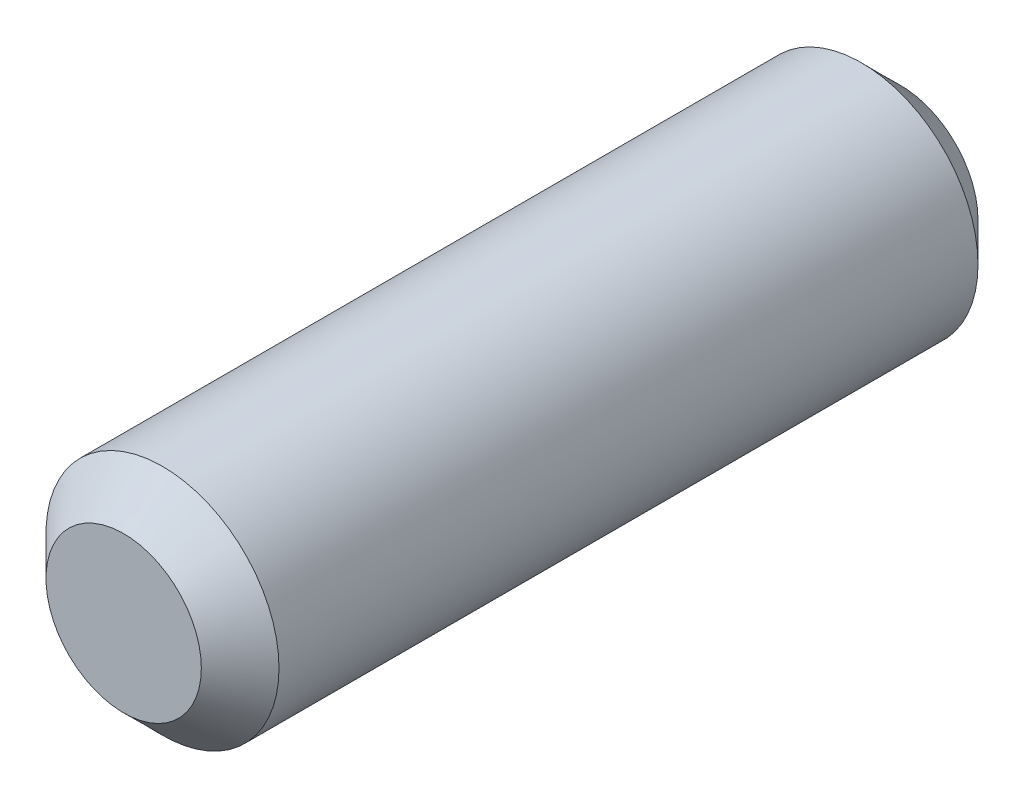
ISO-10303-21;
HEADER;
FILE_DESCRIPTION(('STEP AP214'),'2;1');
FILE_NAME('part.step','',(''),(''),'','','');
FILE_SCHEMA(('AUTOMOTIVE_DESIGN { 1 0 10303 214 1 1 1 1 }'));
ENDSEC;
DATA;
#1=APPLICATION_CONTEXT('core data for automotive mechanical design processes');
#2=APPLICATION_PROTOCOL_DEFINITION('international standard','automotive_design',2000,#1);
#3=PRODUCT_CONTEXT('',#1,'mechanical');
#4=PRODUCT('Part','Part','',(#3));
#5=PRODUCT_RELATED_PRODUCT_CATEGORY('part','',(#4));
#6=PRODUCT_DEFINITION_FORMATION('','',#4);
#7=PRODUCT_DEFINITION_CONTEXT('part definition',#1,'design');
#8=PRODUCT_DEFINITION('design','',#6,#7);
#9=PRODUCT_DEFINITION_SHAPE('','',#8);
#10=(LENGTH_UNIT() NAMED_UNIT(*) SI_UNIT(.MILLI.,.METRE.));
#11=(NAMED_UNIT(*) PLANE_ANGLE_UNIT() SI_UNIT($,.RADIAN.));
#12=(NAMED_UNIT(*) SI_UNIT($,.STERADIAN.) SOLID_ANGLE_UNIT());
#13=UNCERTAINTY_MEASURE_WITH_UNIT(LENGTH_MEASURE(1.E-05),#10,'distance_accuracy_value','');
#14=(GEOMETRIC_REPRESENTATION_CONTEXT(3) GLOBAL_UNCERTAINTY_ASSIGNED_CONTEXT((#13)) GLOBAL_UNIT_ASSIGNED_CONTEXT((#10,
#11,#12)) REPRESENTATION_CONTEXT('',''));
#15=CARTESIAN_POINT('',(0.,0.,0.));
#16=DIRECTION('',(0.,0.,1.));
#17=DIRECTION('',(1.,0.,0.));
#18=AXIS2_PLACEMENT_3D('',#15,#16,#17);
#19=CARTESIAN_POINT('',(0.,-6.03683769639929E-13,20.));
#20=DIRECTION('',(0.,0.,-1.));
#21=DIRECTION('',(-1.,0.,0.));
#22=AXIS2_PLACEMENT_3D('',#19,#20,#21);
#23=CYLINDRICAL_SURFACE('',#22,3.);
#24=CARTESIAN_POINT('',(0.,0.,1.));
#25=DIRECTION('',(0.,0.,1.));
#26=DIRECTION('',(1.,0.,0.));
#27=AXIS2_PLACEMENT_3D('',#24,#25,#26);
#28=CIRCLE('',#27,3.);
#29=CARTESIAN_POINT('',(3.,0.,1.));
#30=VERTEX_POINT('',#29);
#31=EDGE_CURVE('E43',#30,#30,#28,.T.);
#32=ORIENTED_EDGE('',*,*,#31,.T.);
#33=EDGE_LOOP('',(#32));
#34=FACE_BOUND('',#33,.T.);
#35=CARTESIAN_POINT('',(0.,-6.03683769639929E-13,19.));
#36=DIRECTION('',(0.,0.,1.));
#37=DIRECTION('',(1.,0.,0.));
#38=AXIS2_PLACEMENT_3D('',#35,#36,#37);
#39=CIRCLE('',#38,3.);
#40=CARTESIAN_POINT('',(3.,-6.03683769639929E-13,19.));
#41=VERTEX_POINT('',#40);
#42=EDGE_CURVE('E47',#41,#41,#39,.F.);
#43=ORIENTED_EDGE('',*,*,#42,.T.);
#44=EDGE_LOOP('',(#43));
#45=FACE_BOUND('',#44,.T.);
#46=ADVANCED_FACE('F33',(#34,#45),#23,.T.);
#47=CARTESIAN_POINT('',(0.,-6.03683769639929E-13,20.));
#48=DIRECTION('',(0.,0.,1.));
#49=DIRECTION('',(1.,0.,0.));
#50=AXIS2_PLACEMENT_3D('',#47,#48,#49);
#51=PLANE('',#50);
#52=CARTESIAN_POINT('',(0.,-6.03683769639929E-13,20.));
#53=DIRECTION('',(0.,0.,1.));
#54=DIRECTION('',(1.,0.,0.));
#55=AXIS2_PLACEMENT_3D('',#52,#53,#54);
#56=CIRCLE('',#55,2.);
#57=CARTESIAN_POINT('',(2.,-6.03683769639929E-13,20.));
#58=VERTEX_POINT('',#57);
#59=EDGE_CURVE('E10',#58,#58,#56,.T.);
#60=ORIENTED_EDGE('',*,*,#59,.T.);
#61=EDGE_LOOP('',(#60));
#62=FACE_BOUND('',#61,.T.);
#63=ADVANCED_FACE('F66',(#62),#51,.T.);
#64=CARTESIAN_POINT('',(0.,0.,0.));
#65=DIRECTION('',(0.,0.,1.));
#66=DIRECTION('',(1.,0.,0.));
#67=AXIS2_PLACEMENT_3D('',#64,#65,#66);
#68=PLANE('',#67);
#69=CARTESIAN_POINT('',(0.,0.,0.));
#70=DIRECTION('',(0.,0.,1.));
#71=DIRECTION('',(1.,0.,0.));
#72=AXIS2_PLACEMENT_3D('',#69,#70,#71);
#73=CIRCLE('',#72,2.);
#74=CARTESIAN_POINT('',(2.,0.,0.));
#75=VERTEX_POINT('',#74);
#76=EDGE_CURVE('E39',#75,#75,#73,.F.);
#77=ORIENTED_EDGE('',*,*,#76,.T.);
#78=EDGE_LOOP('',(#77));
#79=FACE_BOUND('',#78,.T.);
#80=ADVANCED_FACE('F62',(#79),#68,.F.);
#81=CARTESIAN_POINT('',(0.,0.,1.));
#82=DIRECTION('',(0.,0.,1.));
#83=DIRECTION('',(1.,0.,0.));
#84=AXIS2_PLACEMENT_3D('',#81,#82,#83);
#85=CONICAL_SURFACE('',#84,3.,0.78539816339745);
#86=ORIENTED_EDGE('',*,*,#76,.F.);
#87=EDGE_LOOP('',(#86));
#88=FACE_BOUND('',#87,.T.);
#89=ORIENTED_EDGE('',*,*,#31,.F.);
#90=EDGE_LOOP('',(#89));
#91=FACE_BOUND('',#90,.T.);
#92=ADVANCED_FACE('F57',(#88,#91),#85,.T.);
#93=CARTESIAN_POINT('',(0.,-6.03683769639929E-13,20.));
#94=DIRECTION('',(0.,0.,-1.));
#95=DIRECTION('',(-1.,0.,0.));
#96=AXIS2_PLACEMENT_3D('',#93,#94,#95);
#97=CONICAL_SURFACE('',#96,2.,0.785398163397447);
#98=ORIENTED_EDGE('',*,*,#42,.F.);
#99=EDGE_LOOP('',(#98));
#100=FACE_BOUND('',#99,.T.);
#101=ORIENTED_EDGE('',*,*,#59,.F.);
#102=EDGE_LOOP('',(#101));
#103=FACE_BOUND('',#102,.T.);
#104=ADVANCED_FACE('F54',(#100,#103),#97,.T.);
#105=CLOSED_SHELL('',(#46,#63,#80,#92,#104));
#106=MANIFOLD_SOLID_BREP('B2',#105);
#107=ADVANCED_BREP_SHAPE_REPRESENTATION('',(#18,#106),#14);
#108=SHAPE_DEFINITION_REPRESENTATION(#9,#107);
ENDSEC;
END-ISO-10303-21;
